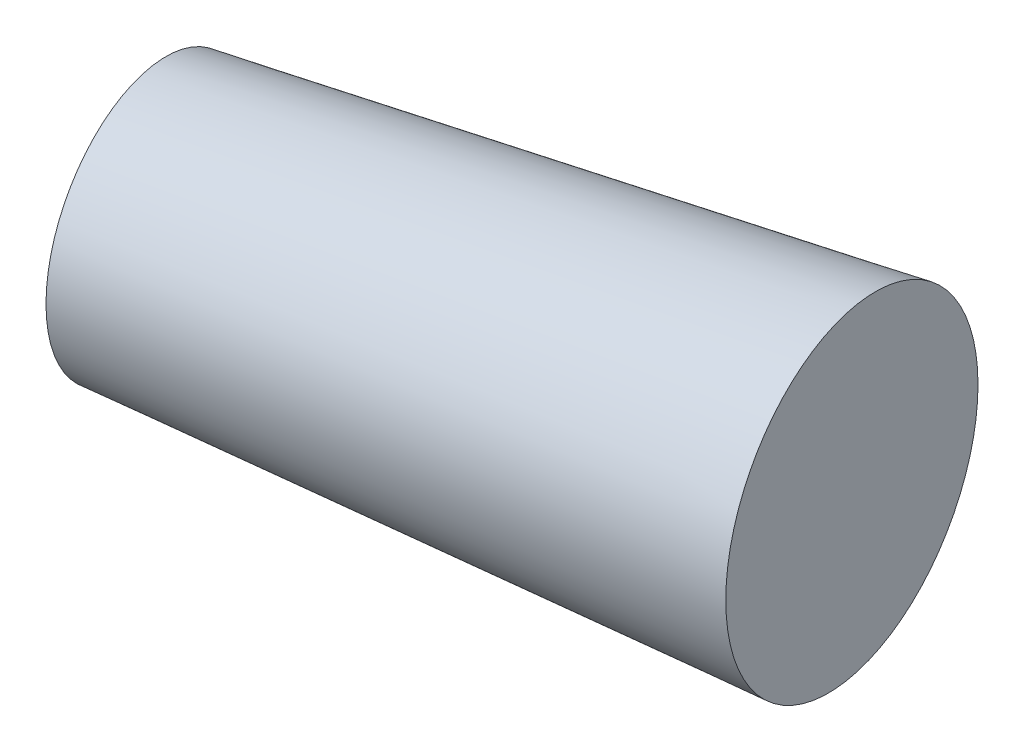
ISO-10303-21;
HEADER;
FILE_DESCRIPTION(('STEP AP214'),'2;1');
FILE_NAME('part.step','',(''),(''),'','','');
FILE_SCHEMA(('AUTOMOTIVE_DESIGN { 1 0 10303 214 1 1 1 1 }'));
ENDSEC;
DATA;
#1=APPLICATION_CONTEXT('core data for automotive mechanical design processes');
#2=APPLICATION_PROTOCOL_DEFINITION('international standard','automotive_design',2000,#1);
#3=PRODUCT_CONTEXT('',#1,'mechanical');
#4=PRODUCT('Part','Part','',(#3));
#5=PRODUCT_RELATED_PRODUCT_CATEGORY('part','',(#4));
#6=PRODUCT_DEFINITION_FORMATION('','',#4);
#7=PRODUCT_DEFINITION_CONTEXT('part definition',#1,'design');
#8=PRODUCT_DEFINITION('design','',#6,#7);
#9=PRODUCT_DEFINITION_SHAPE('','',#8);
#10=(LENGTH_UNIT() NAMED_UNIT(*) SI_UNIT(.MILLI.,.METRE.));
#11=(NAMED_UNIT(*) PLANE_ANGLE_UNIT() SI_UNIT($,.RADIAN.));
#12=(NAMED_UNIT(*) SI_UNIT($,.STERADIAN.) SOLID_ANGLE_UNIT());
#13=UNCERTAINTY_MEASURE_WITH_UNIT(LENGTH_MEASURE(1.E-05),#10,'distance_accuracy_value','');
#14=(GEOMETRIC_REPRESENTATION_CONTEXT(3) GLOBAL_UNCERTAINTY_ASSIGNED_CONTEXT((#13)) GLOBAL_UNIT_ASSIGNED_CONTEXT((#10,
#11,#12)) REPRESENTATION_CONTEXT('',''));
#15=CARTESIAN_POINT('',(0.,0.,0.));
#16=DIRECTION('',(0.,0.,1.));
#17=DIRECTION('',(1.,0.,0.));
#18=AXIS2_PLACEMENT_3D('',#15,#16,#17);
#19=CARTESIAN_POINT('',(3.97743975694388,0.,-0.769827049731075));
#20=DIRECTION('',(0.981779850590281,0.,-0.190021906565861));
#21=DIRECTION('',(-0.190021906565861,0.,-0.981779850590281));
#22=AXIS2_PLACEMENT_3D('',#19,#20,#21);
#23=CONICAL_SURFACE('',#22,2.75,0.05235987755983);
#24=CARTESIAN_POINT('',(-6.21765885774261,0.,1.20341784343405));
#25=DIRECTION('',(-0.981779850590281,0.,0.190021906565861));
#26=DIRECTION('',(0.190021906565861,0.,0.981779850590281));
#27=AXIS2_PLACEMENT_3D('',#24,#25,#26);
#28=CIRCLE('',#27,2.20578178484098);
#29=CARTESIAN_POINT('',(-5.79851199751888,0.,3.36900995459));
#30=VERTEX_POINT('',#29);
#31=EDGE_CURVE('E10',#30,#30,#28,.T.);
#32=ORIENTED_EDGE('',*,*,#31,.F.);
#33=EDGE_LOOP('',(#32));
#34=FACE_BOUND('',#33,.T.);
#35=CARTESIAN_POINT('',(3.97743975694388,0.,-0.769827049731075));
#36=DIRECTION('',(-0.981779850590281,0.,0.190021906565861));
#37=DIRECTION('',(0.190021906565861,0.,0.981779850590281));
#38=AXIS2_PLACEMENT_3D('',#35,#36,#37);
#39=CIRCLE('',#38,2.75);
#40=CARTESIAN_POINT('',(4.5,0.,1.9300675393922));
#41=VERTEX_POINT('',#40);
#42=EDGE_CURVE('E35',#41,#41,#39,.T.);
#43=ORIENTED_EDGE('',*,*,#42,.T.);
#44=EDGE_LOOP('',(#43));
#45=FACE_BOUND('',#44,.T.);
#46=ADVANCED_FACE('F29',(#34,#45),#23,.T.);
#47=CARTESIAN_POINT('',(-6.21765885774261,0.,1.20341784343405));
#48=DIRECTION('',(0.981779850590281,0.,-0.190021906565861));
#49=DIRECTION('',(-0.190021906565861,0.,-0.981779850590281));
#50=AXIS2_PLACEMENT_3D('',#47,#48,#49);
#51=PLANE('',#50);
#52=ORIENTED_EDGE('',*,*,#31,.T.);
#53=EDGE_LOOP('',(#52));
#54=FACE_BOUND('',#53,.T.);
#55=ADVANCED_FACE('F44',(#54),#51,.F.);
#56=CARTESIAN_POINT('',(3.97743975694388,0.,-0.769827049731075));
#57=DIRECTION('',(-0.981779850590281,0.,0.190021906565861));
#58=DIRECTION('',(0.190021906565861,0.,0.981779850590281));
#59=AXIS2_PLACEMENT_3D('',#56,#57,#58);
#60=PLANE('',#59);
#61=ORIENTED_EDGE('',*,*,#42,.F.);
#62=EDGE_LOOP('',(#61));
#63=FACE_BOUND('',#62,.T.);
#64=ADVANCED_FACE('F42',(#63),#60,.F.);
#65=CLOSED_SHELL('',(#46,#55,#64));
#66=MANIFOLD_SOLID_BREP('B2',#65);
#67=ADVANCED_BREP_SHAPE_REPRESENTATION('',(#18,#66),#14);
#68=SHAPE_DEFINITION_REPRESENTATION(#9,#67);
ENDSEC;
END-ISO-10303-21;
